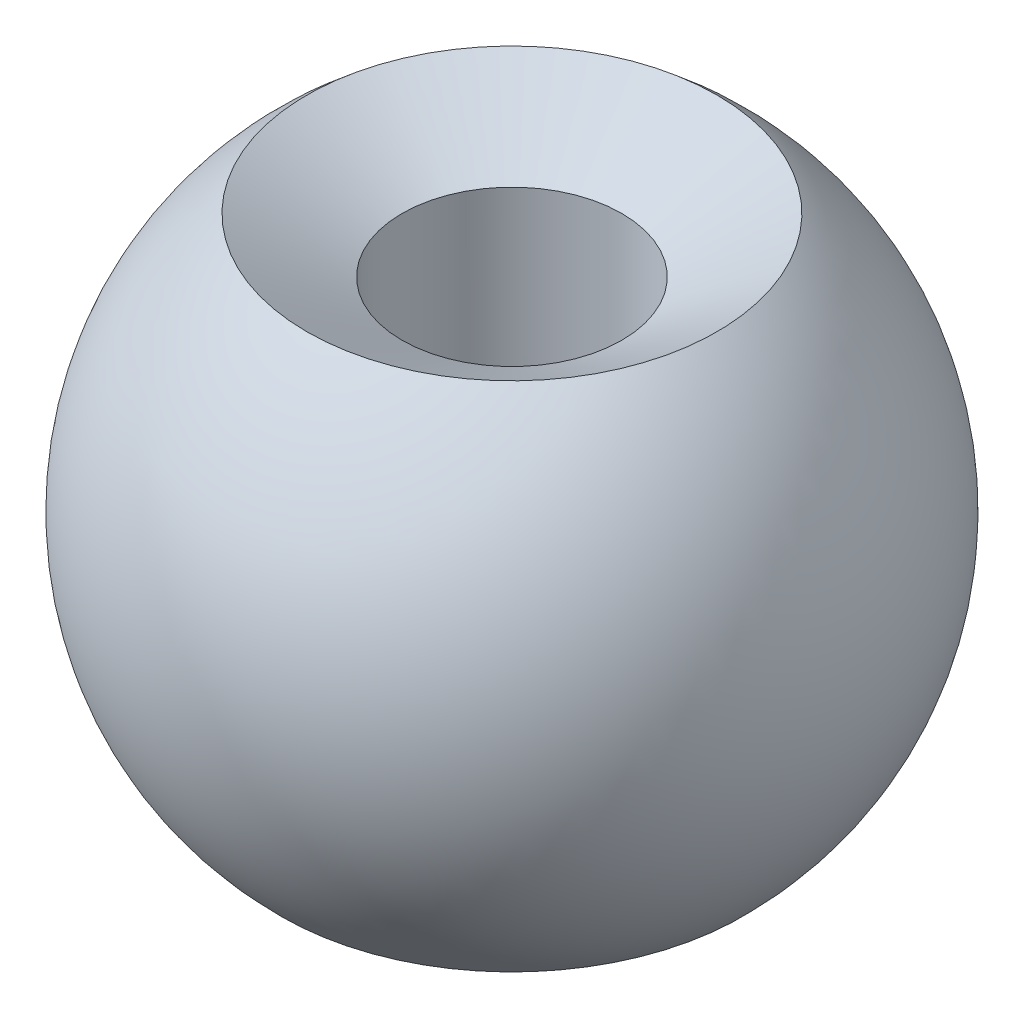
from build123d import *


with BuildPart() as part:
    # Sketch1 → Revolve1 (revolve)
    with BuildSketch(Plane.XY, mode=Mode.PRIVATE) as revolve1_sk:
        with BuildLine():
            Line((2, 0), (2, 8))
            Line((2, 8), (3.732050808, 9))
            ThreePointArc((3.732050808, 9), (5.992498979, 4.60186354), (4.182503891, 0))
            Line((4.182503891, 0), (2, 0))
        make_face()
    revolve(revolve1_sk.sketch.rotate(Axis((0, 0, 0), (0, 1, 0)), 270), axis=Axis((0, 0, 0), (0, 1, 0)))


solid = part.part
